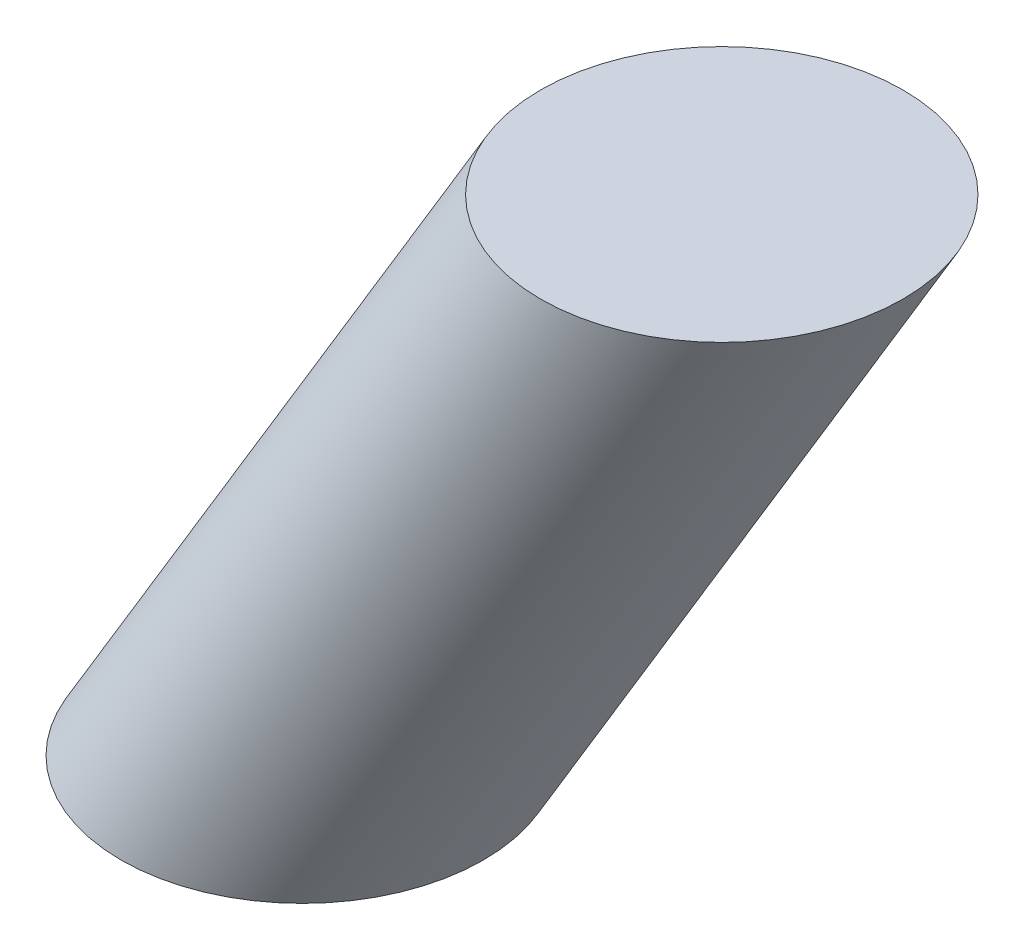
from build123d import *

# Parameters (mm, degrees)
SKETCH2_R = 22.234217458


with BuildPart() as part:
    # Sweep1: sweep along a path in Sketch1
    with BuildLine(Plane.XY) as sweep1_path:
        Line((0, 0), (51.48679078, 85.364716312))
    # Sketch2 → Sweep1 (sweep)
    with BuildSketch(Plane(origin=(0, 0, 0), x_dir=(1, 0, 0), z_dir=(0, 1, 0))):
        Circle(SKETCH2_R)
    sweep(path=sweep1_path.line)


solid = part.part
